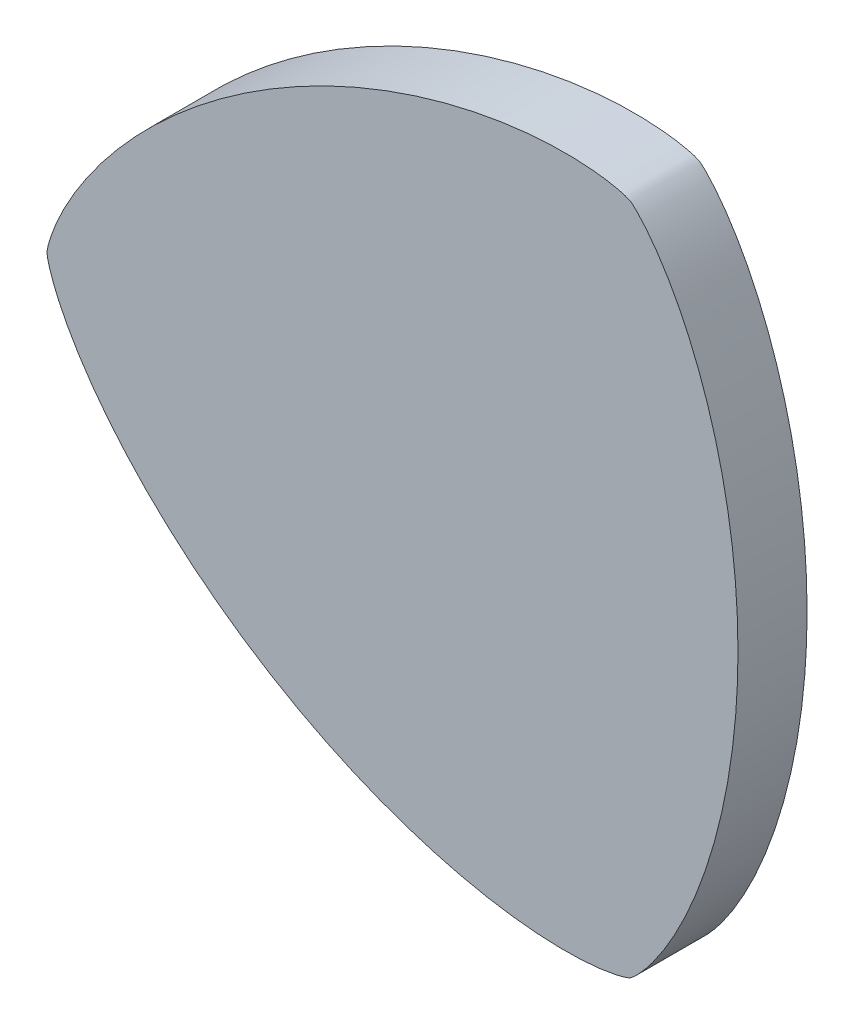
from build123d import *

# Parameters (mm, degrees)
LINEAR_AUSTRAGEN1_DEPTH = 10


with BuildPart() as part:
    # Skizze1 → Linear austragen1 (new body)
    with BuildSketch(Plane.XY):
        with BuildLine():
            add(Edge.make_bspline(
                [(43.75, 0), (43.75, 3.462126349), (43.400250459, 10.218329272), (41.894774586, 19.84499143), (39.641899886, 28.366874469), (36.976127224, 35.41597276), (34.273758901, 40.809514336), (31.88413691, 44.567698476), (30.055699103, 46.880432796), (28.897639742, 48.087790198), (28.331332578, 48.565254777), (28.126623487, 48.716740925), (27.893078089, 48.818281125), (27.196428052, 49.069985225), (25.57179619, 49.469215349), (22.654690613, 49.89632178), (18.205196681, 50.086703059), (12.183068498, 49.73025189), (4.745483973, 48.51432959), (-3.761120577, 46.204434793), (-12.850792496, 42.694884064), (-21.964612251, 38.043824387), (-30.549457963, 32.476554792), (-38.13365401, 26.359443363), (-44.387383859, 20.147455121), (-49.159195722, 14.314279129), (-52.478955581, 9.277188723), (-54.538827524, 5.328623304), (-55.627495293, 2.588782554), (-56.094067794, 0.982195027), (-56.224410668, 0.253026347), (-56.253246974, 0), (-56.224410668, -0.253026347), (-56.094067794, -0.982195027), (-55.627495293, -2.588782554), (-54.538827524, -5.328623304), (-52.478955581, -9.277188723), (-49.159195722, -14.314279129), (-44.387383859, -20.147455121), (-38.13365401, -26.359443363), (-30.549457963, -32.476554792), (-21.964612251, -38.043824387), (-12.850792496, -42.694884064), (-3.761120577, -46.204434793), (4.745483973, -48.51432959), (12.183068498, -49.73025189), (18.205196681, -50.086703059), (22.654690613, -49.89632178), (25.57179619, -49.469215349), (27.196428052, -49.069985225), (27.893078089, -48.818281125), (28.126623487, -48.716740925), (28.331332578, -48.565254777), (28.897639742, -48.087790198), (30.055699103, -46.880432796), (31.88413691, -44.567698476), (34.273758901, -40.809514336), (36.976127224, -35.41597276), (39.641899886, -28.366874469), (41.894774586, -19.84499143), (43.400250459, -10.218329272), (43.75, -3.462126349), (43.75, 0)],
                knots=[0, 0, 0, 0, 0.033060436, 0.064516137, 0.092919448, 0.117121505, 0.136384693, 0.150454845, 0.159586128, 0.164516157, 0.166393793, 0.166666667, 0.16693954, 0.168817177, 0.173747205, 0.182878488, 0.196948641, 0.216211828, 0.240413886, 0.268817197, 0.300272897, 0.333333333, 0.36639377, 0.39784947, 0.426252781, 0.450454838, 0.469718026, 0.483788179, 0.492919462, 0.49784949, 0.499727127, 0.5, 0.500272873, 0.50215051, 0.507080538, 0.516211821, 0.530281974, 0.549545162, 0.573747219, 0.60215053, 0.63360623, 0.666666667, 0.699727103, 0.731182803, 0.759586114, 0.783788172, 0.803051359, 0.817121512, 0.826252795, 0.831182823, 0.83306046, 0.833333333, 0.833606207, 0.835483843, 0.840413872, 0.849545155, 0.863615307, 0.882878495, 0.907080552, 0.935483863, 0.966939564, 1, 1, 1, 1], degree=3))
        make_face()
    extrude(amount=LINEAR_AUSTRAGEN1_DEPTH)


solid = part.part
